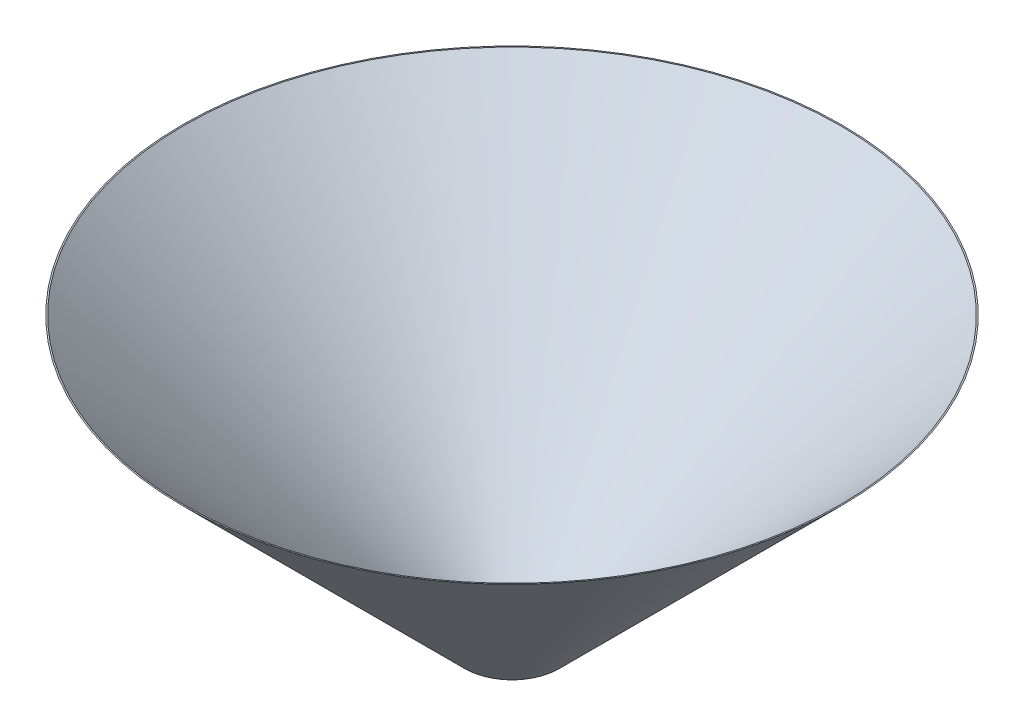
ISO-10303-21;
HEADER;
FILE_DESCRIPTION(('STEP AP214'),'2;1');
FILE_NAME('part.step','',(''),(''),'','','');
FILE_SCHEMA(('AUTOMOTIVE_DESIGN { 1 0 10303 214 1 1 1 1 }'));
ENDSEC;
DATA;
#1=APPLICATION_CONTEXT('core data for automotive mechanical design processes');
#2=APPLICATION_PROTOCOL_DEFINITION('international standard','automotive_design',2000,#1);
#3=PRODUCT_CONTEXT('',#1,'mechanical');
#4=PRODUCT('Part','Part','',(#3));
#5=PRODUCT_RELATED_PRODUCT_CATEGORY('part','',(#4));
#6=PRODUCT_DEFINITION_FORMATION('','',#4);
#7=PRODUCT_DEFINITION_CONTEXT('part definition',#1,'design');
#8=PRODUCT_DEFINITION('design','',#6,#7);
#9=PRODUCT_DEFINITION_SHAPE('','',#8);
#10=(LENGTH_UNIT() NAMED_UNIT(*) SI_UNIT(.MILLI.,.METRE.));
#11=(NAMED_UNIT(*) PLANE_ANGLE_UNIT() SI_UNIT($,.RADIAN.));
#12=(NAMED_UNIT(*) SI_UNIT($,.STERADIAN.) SOLID_ANGLE_UNIT());
#13=UNCERTAINTY_MEASURE_WITH_UNIT(LENGTH_MEASURE(1.E-05),#10,'distance_accuracy_value','');
#14=(GEOMETRIC_REPRESENTATION_CONTEXT(3) GLOBAL_UNCERTAINTY_ASSIGNED_CONTEXT((#13)) GLOBAL_UNIT_ASSIGNED_CONTEXT((#10,
#11,#12)) REPRESENTATION_CONTEXT('',''));
#15=CARTESIAN_POINT('',(0.,0.,0.));
#16=DIRECTION('',(0.,0.,1.));
#17=DIRECTION('',(1.,0.,0.));
#18=AXIS2_PLACEMENT_3D('',#15,#16,#17);
#19=CARTESIAN_POINT('',(0.,-0.707106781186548,0.));
#20=DIRECTION('',(0.,1.,0.));
#21=DIRECTION('',(0.,0.,1.));
#22=AXIS2_PLACEMENT_3D('',#19,#20,#21);
#23=CONICAL_SURFACE('',#22,50.7071067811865,0.78539816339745);
#24=CARTESIAN_POINT('',(0.,300.,0.));
#25=DIRECTION('',(0.,1.,0.));
#26=DIRECTION('',(0.,0.,1.));
#27=AXIS2_PLACEMENT_3D('',#24,#25,#26);
#28=CIRCLE('',#27,351.414213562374);
#29=CARTESIAN_POINT('',(0.,300.,351.414213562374));
#30=VERTEX_POINT('',#29);
#31=EDGE_CURVE('E10',#30,#30,#28,.T.);
#32=CARTESIAN_POINT('',(0.,-1.,0.));
#33=DIRECTION('',(0.,1.,0.));
#34=DIRECTION('',(0.,0.,1.));
#35=AXIS2_PLACEMENT_3D('',#32,#33,#34);
#36=CIRCLE('',#35,50.4142135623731);
#37=CARTESIAN_POINT('',(0.,-1.,50.4142135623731));
#38=VERTEX_POINT('',#37);
#39=EDGE_CURVE('E38',#38,#38,#36,.T.);
#40=CARTESIAN_POINT('',(0.,300.,351.414213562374));
#41=CARTESIAN_POINT('',(0.,296.864583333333,348.278796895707));
#42=CARTESIAN_POINT('',(0.,293.729166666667,345.14338022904));
#43=CARTESIAN_POINT('',(0.,287.458333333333,338.872546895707));
#44=CARTESIAN_POINT('',(0.,284.322916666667,335.73713022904));
#45=CARTESIAN_POINT('',(0.,278.052083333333,329.466296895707));
#46=CARTESIAN_POINT('',(0.,274.916666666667,326.33088022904));
#47=CARTESIAN_POINT('',(0.,268.645833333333,320.060046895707));
#48=CARTESIAN_POINT('',(0.,265.510416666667,316.92463022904));
#49=CARTESIAN_POINT('',(0.,259.239583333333,310.653796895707));
#50=CARTESIAN_POINT('',(0.,256.104166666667,307.51838022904));
#51=CARTESIAN_POINT('',(0.,249.833333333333,301.247546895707));
#52=CARTESIAN_POINT('',(0.,246.697916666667,298.11213022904));
#53=CARTESIAN_POINT('',(0.,240.427083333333,291.841296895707));
#54=CARTESIAN_POINT('',(0.,237.291666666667,288.70588022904));
#55=CARTESIAN_POINT('',(0.,231.020833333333,282.435046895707));
#56=CARTESIAN_POINT('',(0.,227.885416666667,279.29963022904));
#57=CARTESIAN_POINT('',(0.,221.614583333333,273.028796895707));
#58=CARTESIAN_POINT('',(0.,218.479166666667,269.89338022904));
#59=CARTESIAN_POINT('',(0.,212.208333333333,263.622546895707));
#60=CARTESIAN_POINT('',(0.,209.072916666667,260.48713022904));
#61=CARTESIAN_POINT('',(0.,202.802083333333,254.216296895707));
#62=CARTESIAN_POINT('',(0.,199.666666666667,251.08088022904));
#63=CARTESIAN_POINT('',(0.,193.395833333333,244.810046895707));
#64=CARTESIAN_POINT('',(0.,190.260416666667,241.67463022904));
#65=CARTESIAN_POINT('',(0.,183.989583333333,235.403796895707));
#66=CARTESIAN_POINT('',(0.,180.854166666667,232.26838022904));
#67=CARTESIAN_POINT('',(0.,174.583333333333,225.997546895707));
#68=CARTESIAN_POINT('',(0.,171.447916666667,222.86213022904));
#69=CARTESIAN_POINT('',(0.,165.177083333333,216.591296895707));
#70=CARTESIAN_POINT('',(0.,162.041666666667,213.45588022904));
#71=CARTESIAN_POINT('',(0.,155.770833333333,207.185046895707));
#72=CARTESIAN_POINT('',(0.,152.635416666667,204.04963022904));
#73=CARTESIAN_POINT('',(0.,146.364583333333,197.778796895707));
#74=CARTESIAN_POINT('',(0.,143.229166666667,194.64338022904));
#75=CARTESIAN_POINT('',(0.,136.958333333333,188.372546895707));
#76=CARTESIAN_POINT('',(0.,133.822916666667,185.23713022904));
#77=CARTESIAN_POINT('',(0.,127.552083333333,178.966296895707));
#78=CARTESIAN_POINT('',(0.,124.416666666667,175.83088022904));
#79=CARTESIAN_POINT('',(0.,118.145833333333,169.560046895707));
#80=CARTESIAN_POINT('',(0.,115.010416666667,166.42463022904));
#81=CARTESIAN_POINT('',(0.,108.739583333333,160.153796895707));
#82=CARTESIAN_POINT('',(0.,105.604166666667,157.01838022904));
#83=CARTESIAN_POINT('',(0.,99.3333333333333,150.747546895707));
#84=CARTESIAN_POINT('',(0.,96.1979166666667,147.61213022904));
#85=CARTESIAN_POINT('',(0.,89.9270833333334,141.341296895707));
#86=CARTESIAN_POINT('',(0.,86.7916666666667,138.20588022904));
#87=CARTESIAN_POINT('',(0.,80.5208333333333,131.935046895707));
#88=CARTESIAN_POINT('',(0.,77.3854166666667,128.79963022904));
#89=CARTESIAN_POINT('',(0.,71.1145833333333,122.528796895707));
#90=CARTESIAN_POINT('',(0.,67.9791666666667,119.39338022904));
#91=CARTESIAN_POINT('',(0.,61.7083333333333,113.122546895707));
#92=CARTESIAN_POINT('',(0.,58.5729166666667,109.98713022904));
#93=CARTESIAN_POINT('',(0.,52.3020833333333,103.716296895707));
#94=CARTESIAN_POINT('',(0.,49.1666666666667,100.58088022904));
#95=CARTESIAN_POINT('',(0.,42.8958333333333,94.3100468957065));
#96=CARTESIAN_POINT('',(0.,39.7604166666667,91.1746302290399));
#97=CARTESIAN_POINT('',(0.,33.4895833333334,84.9037968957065));
#98=CARTESIAN_POINT('',(0.,30.3541666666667,81.7683802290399));
#99=CARTESIAN_POINT('',(0.,24.0833333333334,75.4975468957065));
#100=CARTESIAN_POINT('',(0.,20.9479166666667,72.3621302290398));
#101=CARTESIAN_POINT('',(0.,14.6770833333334,66.0912968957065));
#102=CARTESIAN_POINT('',(0.,11.5416666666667,62.9558802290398));
#103=CARTESIAN_POINT('',(0.,5.27083333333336,56.6850468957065));
#104=CARTESIAN_POINT('',(0.,2.13541666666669,53.5496302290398));
#105=CARTESIAN_POINT('',(0.,-0.999999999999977,50.4142135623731));
#106=B_SPLINE_CURVE_WITH_KNOTS('',3,(#40,#41,#42,#43,#44,#45,#46,#47,#48,#49,#50,#51,#52,#53,
#54,#55,#56,#57,#58,#59,#60,#61,#62,#63,#64,#65,#66,#67,#68,#69,#70,#71,#72,#73,#74,#75,#76,#77,
#78,#79,#80,#81,#82,#83,#84,#85,#86,#87,#88,#89,#90,#91,#92,#93,#94,#95,#96,#97,#98,#99,#100,
#101,#102,#103,#104,#105),.UNSPECIFIED.,.F.,.F.,(4,2,2,2,2,2,2,2,2,2,2,2,2,2,2,2,2,2,2,2,2,2,2,
2,2,2,2,2,2,2,2,2,4),(0.,13.3024463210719,26.6048926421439,39.9073389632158,53.2097852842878,
66.5122316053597,79.8146779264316,93.1171242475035,106.419570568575,119.722016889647,
133.024463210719,146.326909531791,159.629355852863,172.931802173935,186.234248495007,
199.536694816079,212.839141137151,226.141587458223,239.444033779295,252.746480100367,
266.048926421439,279.351372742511,292.653819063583,305.956265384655,319.258711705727,
332.561158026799,345.86360434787,359.166050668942,372.468496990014,385.770943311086,
399.073389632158,412.37583595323,425.678282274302),.UNSPECIFIED.);
#107=EDGE_CURVE('BSEAM31',#30,#38,#106,.T.);
#108=ORIENTED_EDGE('',*,*,#31,.F.);
#109=ORIENTED_EDGE('',*,*,#39,.T.);
#110=ORIENTED_EDGE('',*,*,#107,.T.);
#111=ORIENTED_EDGE('',*,*,#107,.F.);
#112=EDGE_LOOP('',(#108,#110,#109,#111));
#113=FACE_BOUND('',#112,.T.);
#114=ADVANCED_FACE('F31',(#113),#23,.T.);
#115=CARTESIAN_POINT('',(0.,300.,0.));
#116=DIRECTION('',(0.,1.,0.));
#117=DIRECTION('',(0.,0.,1.));
#118=AXIS2_PLACEMENT_3D('',#115,#116,#117);
#119=PLANE('',#118);
#120=CARTESIAN_POINT('',(0.,300.,0.));
#121=DIRECTION('',(0.,1.,0.));
#122=DIRECTION('',(0.,0.,1.));
#123=AXIS2_PLACEMENT_3D('',#120,#121,#122);
#124=CIRCLE('',#123,350.000000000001);
#125=CARTESIAN_POINT('',(0.,300.,350.000000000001));
#126=VERTEX_POINT('',#125);
#127=EDGE_CURVE('E42',#126,#126,#124,.T.);
#128=ORIENTED_EDGE('',*,*,#127,.F.);
#129=EDGE_LOOP('',(#128));
#130=FACE_BOUND('',#129,.T.);
#131=ORIENTED_EDGE('',*,*,#31,.T.);
#132=EDGE_LOOP('',(#131));
#133=FACE_BOUND('',#132,.T.);
#134=ADVANCED_FACE('F63',(#130,#133),#119,.T.);
#135=CARTESIAN_POINT('',(0.,-1.,0.));
#136=DIRECTION('',(0.,1.,0.));
#137=DIRECTION('',(0.,0.,1.));
#138=AXIS2_PLACEMENT_3D('',#135,#136,#137);
#139=PLANE('',#138);
#140=ORIENTED_EDGE('',*,*,#39,.F.);
#141=EDGE_LOOP('',(#140));
#142=FACE_BOUND('',#141,.T.);
#143=ADVANCED_FACE('F33',(#142),#139,.F.);
#144=CARTESIAN_POINT('',(0.,0.,0.));
#145=DIRECTION('',(0.,1.,0.));
#146=DIRECTION('',(0.,0.,1.));
#147=AXIS2_PLACEMENT_3D('',#144,#145,#146);
#148=CONICAL_SURFACE('',#147,50.,0.78539816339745);
#149=CARTESIAN_POINT('',(0.,0.,0.));
#150=DIRECTION('',(0.,1.,0.));
#151=DIRECTION('',(0.,0.,1.));
#152=AXIS2_PLACEMENT_3D('',#149,#150,#151);
#153=CIRCLE('',#152,50.);
#154=CARTESIAN_POINT('',(0.,0.,50.));
#155=VERTEX_POINT('',#154);
#156=EDGE_CURVE('E46',#155,#155,#153,.T.);
#157=CARTESIAN_POINT('',(0.,300.,350.000000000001));
#158=CARTESIAN_POINT('',(0.,296.875,346.875000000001));
#159=CARTESIAN_POINT('',(0.,293.75,343.750000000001));
#160=CARTESIAN_POINT('',(0.,287.5,337.500000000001));
#161=CARTESIAN_POINT('',(0.,284.375,334.375000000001));
#162=CARTESIAN_POINT('',(0.,278.125,328.125000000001));
#163=CARTESIAN_POINT('',(0.,275.,325.000000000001));
#164=CARTESIAN_POINT('',(0.,268.75,318.750000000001));
#165=CARTESIAN_POINT('',(0.,265.625,315.625000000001));
#166=CARTESIAN_POINT('',(0.,259.375,309.375000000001));
#167=CARTESIAN_POINT('',(0.,256.25,306.250000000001));
#168=CARTESIAN_POINT('',(0.,250.,300.000000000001));
#169=CARTESIAN_POINT('',(0.,246.875,296.875000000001));
#170=CARTESIAN_POINT('',(0.,240.625,290.625000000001));
#171=CARTESIAN_POINT('',(0.,237.5,287.500000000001));
#172=CARTESIAN_POINT('',(0.,231.25,281.250000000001));
#173=CARTESIAN_POINT('',(0.,228.125,278.125000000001));
#174=CARTESIAN_POINT('',(0.,221.875,271.875000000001));
#175=CARTESIAN_POINT('',(0.,218.75,268.750000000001));
#176=CARTESIAN_POINT('',(0.,212.5,262.500000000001));
#177=CARTESIAN_POINT('',(0.,209.375,259.375));
#178=CARTESIAN_POINT('',(0.,203.125,253.125));
#179=CARTESIAN_POINT('',(0.,200.,250.));
#180=CARTESIAN_POINT('',(0.,193.75,243.75));
#181=CARTESIAN_POINT('',(0.,190.625,240.625));
#182=CARTESIAN_POINT('',(0.,184.375,234.375));
#183=CARTESIAN_POINT('',(0.,181.25,231.25));
#184=CARTESIAN_POINT('',(0.,175.,225.));
#185=CARTESIAN_POINT('',(0.,171.875,221.875));
#186=CARTESIAN_POINT('',(0.,165.625,215.625));
#187=CARTESIAN_POINT('',(0.,162.5,212.5));
#188=CARTESIAN_POINT('',(0.,156.25,206.25));
#189=CARTESIAN_POINT('',(0.,153.125,203.125));
#190=CARTESIAN_POINT('',(0.,146.875,196.875));
#191=CARTESIAN_POINT('',(0.,143.75,193.75));
#192=CARTESIAN_POINT('',(0.,137.5,187.5));
#193=CARTESIAN_POINT('',(0.,134.375,184.375));
#194=CARTESIAN_POINT('',(0.,128.125,178.125));
#195=CARTESIAN_POINT('',(0.,125.,175.));
#196=CARTESIAN_POINT('',(0.,118.75,168.75));
#197=CARTESIAN_POINT('',(0.,115.625,165.625));
#198=CARTESIAN_POINT('',(0.,109.375,159.375));
#199=CARTESIAN_POINT('',(0.,106.25,156.25));
#200=CARTESIAN_POINT('',(0.,100.,150.));
#201=CARTESIAN_POINT('',(0.,96.875,146.875));
#202=CARTESIAN_POINT('',(0.,90.625,140.625));
#203=CARTESIAN_POINT('',(0.,87.5,137.5));
#204=CARTESIAN_POINT('',(0.,81.25,131.25));
#205=CARTESIAN_POINT('',(0.,78.125,128.125));
#206=CARTESIAN_POINT('',(0.,71.875,121.875));
#207=CARTESIAN_POINT('',(0.,68.75,118.75));
#208=CARTESIAN_POINT('',(0.,62.5,112.5));
#209=CARTESIAN_POINT('',(0.,59.375,109.375));
#210=CARTESIAN_POINT('',(0.,53.125,103.125));
#211=CARTESIAN_POINT('',(0.,50.,100.));
#212=CARTESIAN_POINT('',(0.,43.75,93.7500000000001));
#213=CARTESIAN_POINT('',(0.,40.625,90.6250000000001));
#214=CARTESIAN_POINT('',(0.,34.375,84.3750000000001));
#215=CARTESIAN_POINT('',(0.,31.25,81.2500000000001));
#216=CARTESIAN_POINT('',(0.,25.,75.0000000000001));
#217=CARTESIAN_POINT('',(0.,21.875,71.8750000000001));
#218=CARTESIAN_POINT('',(0.,15.625,65.625));
#219=CARTESIAN_POINT('',(0.,12.5,62.5));
#220=CARTESIAN_POINT('',(0.,6.25000000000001,56.25));
#221=CARTESIAN_POINT('',(0.,3.12500000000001,53.125));
#222=CARTESIAN_POINT('',(0.,0.,50.));
#223=B_SPLINE_CURVE_WITH_KNOTS('',3,(#157,#158,#159,#160,#161,#162,#163,#164,#165,#166,#167,
#168,#169,#170,#171,#172,#173,#174,#175,#176,#177,#178,#179,#180,#181,#182,#183,#184,#185,#186,
#187,#188,#189,#190,#191,#192,#193,#194,#195,#196,#197,#198,#199,#200,#201,#202,#203,#204,#205,
#206,#207,#208,#209,#210,#211,#212,#213,#214,#215,#216,#217,#218,#219,#220,#221,#222),
.UNSPECIFIED.,.F.,.F.,(4,2,2,2,2,2,2,2,2,2,2,2,2,2,2,2,2,2,2,2,2,2,2,2,2,2,2,2,2,2,2,2,4),(0.,
13.2582521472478,26.5165042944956,39.7747564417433,53.0330085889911,66.2912607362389,
79.5495128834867,92.8077650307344,106.066017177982,119.32426932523,132.582521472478,
145.840773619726,159.099025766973,172.357277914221,185.615530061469,198.873782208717,
212.132034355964,225.390286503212,238.64853865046,251.906790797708,265.165042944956,
278.423295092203,291.681547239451,304.939799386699,318.198051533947,331.456303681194,
344.714555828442,357.97280797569,371.231060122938,384.489312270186,397.747564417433,
411.005816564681,424.264068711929),.UNSPECIFIED.);
#224=EDGE_CURVE('BSEAM54',#126,#155,#223,.T.);
#225=ORIENTED_EDGE('',*,*,#127,.T.);
#226=ORIENTED_EDGE('',*,*,#156,.F.);
#227=ORIENTED_EDGE('',*,*,#224,.T.);
#228=ORIENTED_EDGE('',*,*,#224,.F.);
#229=EDGE_LOOP('',(#225,#227,#226,#228));
#230=FACE_BOUND('',#229,.T.);
#231=ADVANCED_FACE('F54',(#230),#148,.F.);
#232=CARTESIAN_POINT('',(0.,0.,0.));
#233=DIRECTION('',(0.,1.,0.));
#234=DIRECTION('',(0.,0.,1.));
#235=AXIS2_PLACEMENT_3D('',#232,#233,#234);
#236=PLANE('',#235);
#237=ORIENTED_EDGE('',*,*,#156,.T.);
#238=EDGE_LOOP('',(#237));
#239=FACE_BOUND('',#238,.T.);
#240=ADVANCED_FACE('F52',(#239),#236,.T.);
#241=CLOSED_SHELL('',(#114,#134,#143,#231,#240));
#242=MANIFOLD_SOLID_BREP('B2',#241);
#243=ADVANCED_BREP_SHAPE_REPRESENTATION('',(#18,#242),#14);
#244=SHAPE_DEFINITION_REPRESENTATION(#9,#243);
ENDSEC;
END-ISO-10303-21;
